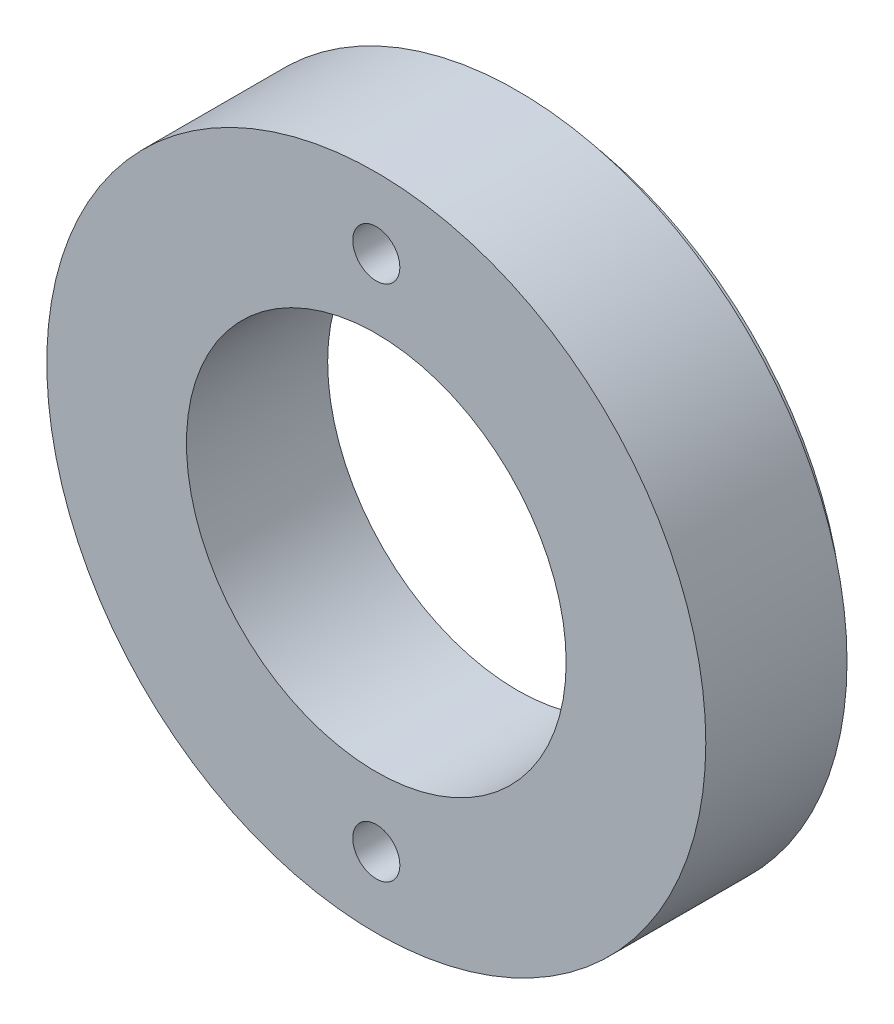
ISO-10303-21;
HEADER;
FILE_DESCRIPTION(('STEP AP214'),'2;1');
FILE_NAME('part.step','',(''),(''),'','','');
FILE_SCHEMA(('AUTOMOTIVE_DESIGN { 1 0 10303 214 1 1 1 1 }'));
ENDSEC;
DATA;
#1=APPLICATION_CONTEXT('core data for automotive mechanical design processes');
#2=APPLICATION_PROTOCOL_DEFINITION('international standard','automotive_design',2000,#1);
#3=PRODUCT_CONTEXT('',#1,'mechanical');
#4=PRODUCT('Part','Part','',(#3));
#5=PRODUCT_RELATED_PRODUCT_CATEGORY('part','',(#4));
#6=PRODUCT_DEFINITION_FORMATION('','',#4);
#7=PRODUCT_DEFINITION_CONTEXT('part definition',#1,'design');
#8=PRODUCT_DEFINITION('design','',#6,#7);
#9=PRODUCT_DEFINITION_SHAPE('','',#8);
#10=(LENGTH_UNIT() NAMED_UNIT(*) SI_UNIT(.MILLI.,.METRE.));
#11=(NAMED_UNIT(*) PLANE_ANGLE_UNIT() SI_UNIT($,.RADIAN.));
#12=(NAMED_UNIT(*) SI_UNIT($,.STERADIAN.) SOLID_ANGLE_UNIT());
#13=UNCERTAINTY_MEASURE_WITH_UNIT(LENGTH_MEASURE(1.E-05),#10,'distance_accuracy_value','');
#14=(GEOMETRIC_REPRESENTATION_CONTEXT(3) GLOBAL_UNCERTAINTY_ASSIGNED_CONTEXT((#13)) GLOBAL_UNIT_ASSIGNED_CONTEXT((#10,
#11,#12)) REPRESENTATION_CONTEXT('',''));
#15=CARTESIAN_POINT('',(0.,0.,0.));
#16=DIRECTION('',(0.,0.,1.));
#17=DIRECTION('',(1.,0.,0.));
#18=AXIS2_PLACEMENT_3D('',#15,#16,#17);
#19=CARTESIAN_POINT('',(0.,0.,40.));
#20=DIRECTION('',(0.,0.,1.));
#21=DIRECTION('',(1.,0.,0.));
#22=AXIS2_PLACEMENT_3D('',#19,#20,#21);
#23=CYLINDRICAL_SURFACE('',#22,21.);
#24=CARTESIAN_POINT('',(0.,0.,50.));
#25=DIRECTION('',(0.,0.,1.));
#26=DIRECTION('',(1.,0.,0.));
#27=AXIS2_PLACEMENT_3D('',#24,#25,#26);
#28=CIRCLE('',#27,21.);
#29=CARTESIAN_POINT('',(21.,0.,50.));
#30=VERTEX_POINT('',#29);
#31=EDGE_CURVE('E10',#30,#30,#28,.T.);
#32=ORIENTED_EDGE('',*,*,#31,.F.);
#33=EDGE_LOOP('',(#32));
#34=FACE_BOUND('',#33,.T.);
#35=CARTESIAN_POINT('',(0.,0.,41.));
#36=DIRECTION('',(0.,0.,-1.));
#37=DIRECTION('',(-1.,0.,0.));
#38=AXIS2_PLACEMENT_3D('',#35,#36,#37);
#39=CIRCLE('',#38,21.);
#40=CARTESIAN_POINT('',(-21.,0.,41.));
#41=VERTEX_POINT('',#40);
#42=EDGE_CURVE('E62',#41,#41,#39,.T.);
#43=ORIENTED_EDGE('',*,*,#42,.F.);
#44=EDGE_LOOP('',(#43));
#45=FACE_BOUND('',#44,.T.);
#46=ADVANCED_FACE('F32',(#34,#45),#23,.T.);
#47=CARTESIAN_POINT('',(0.,0.,40.));
#48=DIRECTION('',(0.,0.,1.));
#49=DIRECTION('',(1.,0.,0.));
#50=AXIS2_PLACEMENT_3D('',#47,#48,#49);
#51=CYLINDRICAL_SURFACE('',#50,12.1);
#52=CARTESIAN_POINT('',(0.,0.,50.));
#53=DIRECTION('',(0.,0.,1.));
#54=DIRECTION('',(1.,0.,0.));
#55=AXIS2_PLACEMENT_3D('',#52,#53,#54);
#56=CIRCLE('',#55,12.1);
#57=CARTESIAN_POINT('',(12.1,0.,50.));
#58=VERTEX_POINT('',#57);
#59=EDGE_CURVE('E38',#58,#58,#56,.T.);
#60=ORIENTED_EDGE('',*,*,#59,.T.);
#61=EDGE_LOOP('',(#60));
#62=FACE_BOUND('',#61,.T.);
#63=CARTESIAN_POINT('',(0.,0.,41.));
#64=DIRECTION('',(0.,0.,-1.));
#65=DIRECTION('',(-1.,0.,0.));
#66=AXIS2_PLACEMENT_3D('',#63,#64,#65);
#67=CIRCLE('',#66,12.1);
#68=CARTESIAN_POINT('',(-12.1,0.,41.));
#69=VERTEX_POINT('',#68);
#70=EDGE_CURVE('E61',#69,#69,#67,.F.);
#71=ORIENTED_EDGE('',*,*,#70,.F.);
#72=EDGE_LOOP('',(#71));
#73=FACE_BOUND('',#72,.T.);
#74=ADVANCED_FACE('F86',(#62,#73),#51,.F.);
#75=CARTESIAN_POINT('',(0.,0.,50.));
#76=DIRECTION('',(0.,0.,1.));
#77=DIRECTION('',(1.,0.,0.));
#78=AXIS2_PLACEMENT_3D('',#75,#76,#77);
#79=PLANE('',#78);
#80=CARTESIAN_POINT('',(0.,-16.5,50.));
#81=DIRECTION('',(0.,0.,1.));
#82=DIRECTION('',(1.,0.,0.));
#83=AXIS2_PLACEMENT_3D('',#80,#81,#82);
#84=CIRCLE('',#83,1.5);
#85=CARTESIAN_POINT('',(1.5,-16.5,50.));
#86=VERTEX_POINT('',#85);
#87=EDGE_CURVE('E46',#86,#86,#84,.T.);
#88=ORIENTED_EDGE('',*,*,#87,.F.);
#89=EDGE_LOOP('',(#88));
#90=FACE_BOUND('',#89,.T.);
#91=CARTESIAN_POINT('',(0.,16.5,50.));
#92=DIRECTION('',(0.,0.,1.));
#93=DIRECTION('',(1.,0.,0.));
#94=AXIS2_PLACEMENT_3D('',#91,#92,#93);
#95=CIRCLE('',#94,1.5);
#96=CARTESIAN_POINT('',(1.5,16.5,50.));
#97=VERTEX_POINT('',#96);
#98=EDGE_CURVE('E49',#97,#97,#95,.T.);
#99=ORIENTED_EDGE('',*,*,#98,.F.);
#100=EDGE_LOOP('',(#99));
#101=FACE_BOUND('',#100,.T.);
#102=ORIENTED_EDGE('',*,*,#59,.F.);
#103=EDGE_LOOP('',(#102));
#104=FACE_BOUND('',#103,.T.);
#105=ORIENTED_EDGE('',*,*,#31,.T.);
#106=EDGE_LOOP('',(#105));
#107=FACE_BOUND('',#106,.T.);
#108=ADVANCED_FACE('F91',(#90,#101,#104,#107),#79,.T.);
#109=CARTESIAN_POINT('',(0.,16.5,45.));
#110=DIRECTION('',(0.,0.,1.));
#111=DIRECTION('',(1.,0.,0.));
#112=AXIS2_PLACEMENT_3D('',#109,#110,#111);
#113=CYLINDRICAL_SURFACE('',#112,1.5);
#114=CARTESIAN_POINT('',(0.,16.5,45.));
#115=DIRECTION('',(0.,0.,1.));
#116=DIRECTION('',(1.,0.,0.));
#117=AXIS2_PLACEMENT_3D('',#114,#115,#116);
#118=CIRCLE('',#117,1.5);
#119=CARTESIAN_POINT('',(1.5,16.5,45.));
#120=VERTEX_POINT('',#119);
#121=EDGE_CURVE('E52',#120,#120,#118,.T.);
#122=ORIENTED_EDGE('',*,*,#121,.F.);
#123=EDGE_LOOP('',(#122));
#124=FACE_BOUND('',#123,.T.);
#125=ORIENTED_EDGE('',*,*,#98,.T.);
#126=EDGE_LOOP('',(#125));
#127=FACE_BOUND('',#126,.T.);
#128=ADVANCED_FACE('F96',(#124,#127),#113,.F.);
#129=CARTESIAN_POINT('',(0.,16.5,45.));
#130=DIRECTION('',(0.,0.,1.));
#131=DIRECTION('',(1.,0.,0.));
#132=AXIS2_PLACEMENT_3D('',#129,#130,#131);
#133=PLANE('',#132);
#134=ORIENTED_EDGE('',*,*,#121,.T.);
#135=EDGE_LOOP('',(#134));
#136=FACE_BOUND('',#135,.T.);
#137=ADVANCED_FACE('F131',(#136),#133,.T.);
#138=CARTESIAN_POINT('',(0.,-16.5,45.));
#139=DIRECTION('',(0.,0.,1.));
#140=DIRECTION('',(1.,0.,0.));
#141=AXIS2_PLACEMENT_3D('',#138,#139,#140);
#142=CYLINDRICAL_SURFACE('',#141,1.5);
#143=CARTESIAN_POINT('',(0.,-16.5,45.));
#144=DIRECTION('',(0.,0.,1.));
#145=DIRECTION('',(1.,0.,0.));
#146=AXIS2_PLACEMENT_3D('',#143,#144,#145);
#147=CIRCLE('',#146,1.5);
#148=CARTESIAN_POINT('',(1.5,-16.5,45.));
#149=VERTEX_POINT('',#148);
#150=EDGE_CURVE('E42',#149,#149,#147,.T.);
#151=ORIENTED_EDGE('',*,*,#150,.F.);
#152=EDGE_LOOP('',(#151));
#153=FACE_BOUND('',#152,.T.);
#154=ORIENTED_EDGE('',*,*,#87,.T.);
#155=EDGE_LOOP('',(#154));
#156=FACE_BOUND('',#155,.T.);
#157=ADVANCED_FACE('F125',(#153,#156),#142,.F.);
#158=CARTESIAN_POINT('',(0.,-16.5,45.));
#159=DIRECTION('',(0.,0.,1.));
#160=DIRECTION('',(1.,0.,0.));
#161=AXIS2_PLACEMENT_3D('',#158,#159,#160);
#162=PLANE('',#161);
#163=ORIENTED_EDGE('',*,*,#150,.T.);
#164=EDGE_LOOP('',(#163));
#165=FACE_BOUND('',#164,.T.);
#166=ADVANCED_FACE('F119',(#165),#162,.T.);
#167=CARTESIAN_POINT('',(0.,0.,41.));
#168=DIRECTION('',(0.,0.,-1.));
#169=DIRECTION('',(-1.,0.,0.));
#170=AXIS2_PLACEMENT_3D('',#167,#168,#169);
#171=CYLINDRICAL_SURFACE('',#170,17.5);
#172=CARTESIAN_POINT('',(0.,0.,41.));
#173=DIRECTION('',(0.,0.,-1.));
#174=DIRECTION('',(-1.,0.,0.));
#175=AXIS2_PLACEMENT_3D('',#172,#173,#174);
#176=CIRCLE('',#175,17.5);
#177=CARTESIAN_POINT('',(-17.5,0.,41.));
#178=VERTEX_POINT('',#177);
#179=EDGE_CURVE('E53',#178,#178,#176,.T.);
#180=ORIENTED_EDGE('',*,*,#179,.F.);
#181=EDGE_LOOP('',(#180));
#182=FACE_BOUND('',#181,.T.);
#183=CARTESIAN_POINT('',(0.,0.,40.));
#184=DIRECTION('',(0.,0.,-1.));
#185=DIRECTION('',(-1.,0.,0.));
#186=AXIS2_PLACEMENT_3D('',#183,#184,#185);
#187=CIRCLE('',#186,17.5);
#188=CARTESIAN_POINT('',(-17.5,0.,40.));
#189=VERTEX_POINT('',#188);
#190=EDGE_CURVE('E58',#189,#189,#187,.T.);
#191=ORIENTED_EDGE('',*,*,#190,.T.);
#192=EDGE_LOOP('',(#191));
#193=FACE_BOUND('',#192,.T.);
#194=ADVANCED_FACE('F111',(#182,#193),#171,.F.);
#195=CARTESIAN_POINT('',(0.,0.,41.));
#196=DIRECTION('',(0.,0.,-1.));
#197=DIRECTION('',(-1.,0.,0.));
#198=AXIS2_PLACEMENT_3D('',#195,#196,#197);
#199=PLANE('',#198);
#200=ORIENTED_EDGE('',*,*,#70,.T.);
#201=EDGE_LOOP('',(#200));
#202=FACE_BOUND('',#201,.T.);
#203=ORIENTED_EDGE('',*,*,#179,.T.);
#204=EDGE_LOOP('',(#203));
#205=FACE_BOUND('',#204,.T.);
#206=ADVANCED_FACE('F104',(#202,#205),#199,.T.);
#207=CARTESIAN_POINT('',(0.,0.,40.));
#208=DIRECTION('',(0.,0.,1.));
#209=DIRECTION('',(1.,0.,0.));
#210=AXIS2_PLACEMENT_3D('',#207,#208,#209);
#211=PLANE('',#210);
#212=ORIENTED_EDGE('',*,*,#190,.F.);
#213=EDGE_LOOP('',(#212));
#214=FACE_BOUND('',#213,.T.);
#215=CARTESIAN_POINT('',(0.,0.,40.));
#216=DIRECTION('',(0.,0.,-1.));
#217=DIRECTION('',(-1.,0.,0.));
#218=AXIS2_PLACEMENT_3D('',#215,#216,#217);
#219=CIRCLE('',#218,19.8);
#220=CARTESIAN_POINT('',(-19.8,0.,40.));
#221=VERTEX_POINT('',#220);
#222=EDGE_CURVE('E67',#221,#221,#219,.T.);
#223=ORIENTED_EDGE('',*,*,#222,.T.);
#224=EDGE_LOOP('',(#223));
#225=FACE_BOUND('',#224,.T.);
#226=ADVANCED_FACE('F102',(#214,#225),#211,.F.);
#227=CARTESIAN_POINT('',(0.,0.,41.));
#228=DIRECTION('',(0.,0.,-1.));
#229=DIRECTION('',(-1.,0.,0.));
#230=AXIS2_PLACEMENT_3D('',#227,#228,#229);
#231=CYLINDRICAL_SURFACE('',#230,19.8);
#232=CARTESIAN_POINT('',(0.,0.,41.));
#233=DIRECTION('',(0.,0.,-1.));
#234=DIRECTION('',(-1.,0.,0.));
#235=AXIS2_PLACEMENT_3D('',#232,#233,#234);
#236=CIRCLE('',#235,19.8);
#237=CARTESIAN_POINT('',(-19.8,0.,41.));
#238=VERTEX_POINT('',#237);
#239=EDGE_CURVE('E70',#238,#238,#236,.T.);
#240=ORIENTED_EDGE('',*,*,#239,.T.);
#241=EDGE_LOOP('',(#240));
#242=FACE_BOUND('',#241,.T.);
#243=ORIENTED_EDGE('',*,*,#222,.F.);
#244=EDGE_LOOP('',(#243));
#245=FACE_BOUND('',#244,.T.);
#246=ADVANCED_FACE('F76',(#242,#245),#231,.T.);
#247=CARTESIAN_POINT('',(0.,0.,41.));
#248=DIRECTION('',(0.,0.,-1.));
#249=DIRECTION('',(-1.,0.,0.));
#250=AXIS2_PLACEMENT_3D('',#247,#248,#249);
#251=PLANE('',#250);
#252=ORIENTED_EDGE('',*,*,#239,.F.);
#253=EDGE_LOOP('',(#252));
#254=FACE_BOUND('',#253,.T.);
#255=ORIENTED_EDGE('',*,*,#42,.T.);
#256=EDGE_LOOP('',(#255));
#257=FACE_BOUND('',#256,.T.);
#258=ADVANCED_FACE('F79',(#254,#257),#251,.T.);
#259=CLOSED_SHELL('',(#46,#74,#108,#128,#137,#157,#166,#194,#206,#226,#246,#258));
#260=MANIFOLD_SOLID_BREP('B2',#259);
#261=ADVANCED_BREP_SHAPE_REPRESENTATION('',(#18,#260),#14);
#262=SHAPE_DEFINITION_REPRESENTATION(#9,#261);
ENDSEC;
END-ISO-10303-21;
